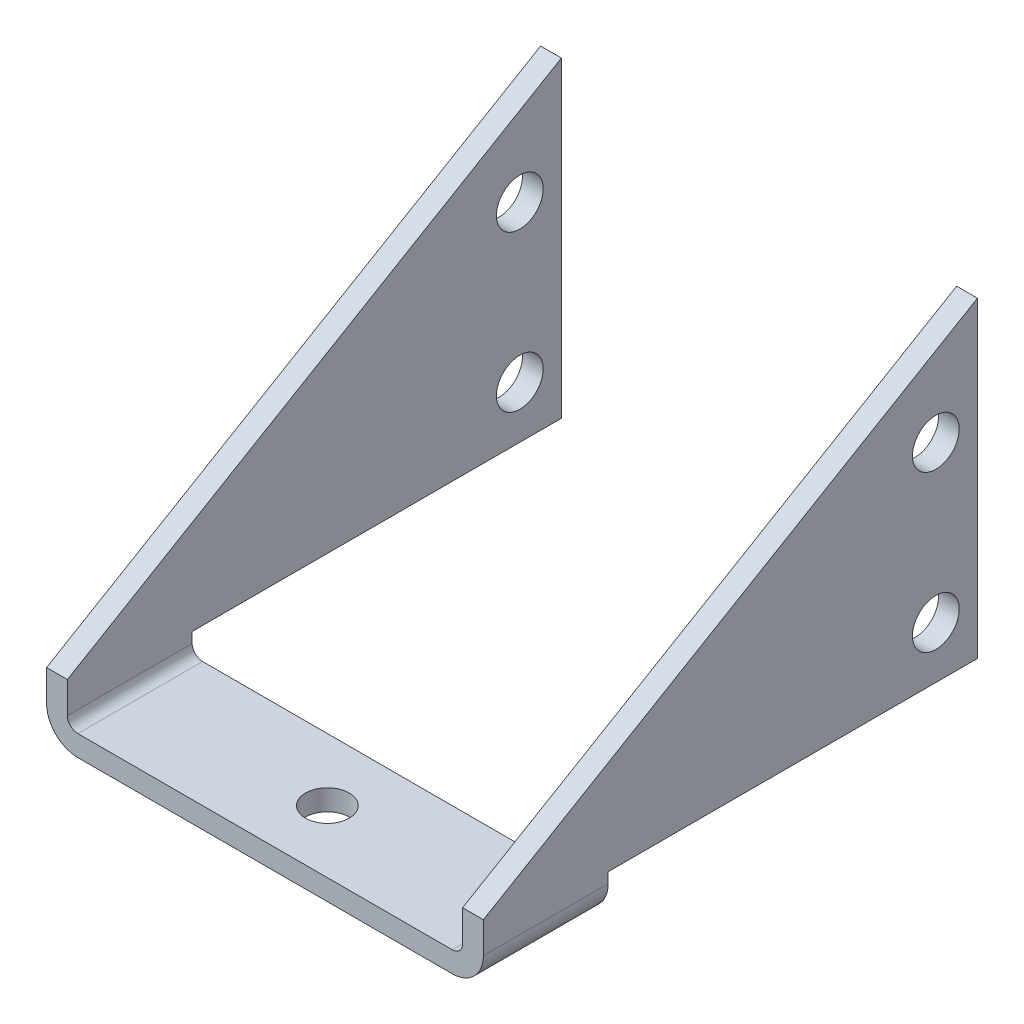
ISO-10303-21;
HEADER;
FILE_DESCRIPTION(('STEP AP214'),'2;1');
FILE_NAME('part.step','',(''),(''),'','','');
FILE_SCHEMA(('AUTOMOTIVE_DESIGN { 1 0 10303 214 1 1 1 1 }'));
ENDSEC;
DATA;
#1=APPLICATION_CONTEXT('core data for automotive mechanical design processes');
#2=APPLICATION_PROTOCOL_DEFINITION('international standard','automotive_design',2000,#1);
#3=PRODUCT_CONTEXT('',#1,'mechanical');
#4=PRODUCT('Part','Part','',(#3));
#5=PRODUCT_RELATED_PRODUCT_CATEGORY('part','',(#4));
#6=PRODUCT_DEFINITION_FORMATION('','',#4);
#7=PRODUCT_DEFINITION_CONTEXT('part definition',#1,'design');
#8=PRODUCT_DEFINITION('design','',#6,#7);
#9=PRODUCT_DEFINITION_SHAPE('','',#8);
#10=(LENGTH_UNIT() NAMED_UNIT(*) SI_UNIT(.MILLI.,.METRE.));
#11=(NAMED_UNIT(*) PLANE_ANGLE_UNIT() SI_UNIT($,.RADIAN.));
#12=(NAMED_UNIT(*) SI_UNIT($,.STERADIAN.) SOLID_ANGLE_UNIT());
#13=UNCERTAINTY_MEASURE_WITH_UNIT(LENGTH_MEASURE(1.E-05),#10,'distance_accuracy_value','');
#14=(GEOMETRIC_REPRESENTATION_CONTEXT(3) GLOBAL_UNCERTAINTY_ASSIGNED_CONTEXT((#13)) GLOBAL_UNIT_ASSIGNED_CONTEXT((#10,
#11,#12)) REPRESENTATION_CONTEXT('',''));
#15=CARTESIAN_POINT('',(0.,0.,0.));
#16=DIRECTION('',(0.,0.,1.));
#17=DIRECTION('',(1.,0.,0.));
#18=AXIS2_PLACEMENT_3D('',#15,#16,#17);
#19=CARTESIAN_POINT('',(21.,0.,0.));
#20=DIRECTION('',(-1.,0.,0.));
#21=DIRECTION('',(0.,0.,1.));
#22=AXIS2_PLACEMENT_3D('',#19,#20,#21);
#23=PLANE('',#22);
#24=DIRECTION('',(0.,0.,1.));
#25=VECTOR('',#24,1.);
#26=CARTESIAN_POINT('',(21.,4.,0.));
#27=LINE('',#26,#25);
#28=CARTESIAN_POINT('',(21.,4.,-6.));
#29=VERTEX_POINT('',#28);
#30=CARTESIAN_POINT('',(21.,4.,-41.5));
#31=VERTEX_POINT('',#30);
#32=EDGE_CURVE('E196',#29,#31,#27,.F.);
#33=ORIENTED_EDGE('',*,*,#32,.T.);
#34=DIRECTION('',(0.,1.,0.));
#35=VECTOR('',#34,1.);
#36=CARTESIAN_POINT('',(21.,34.,-41.5));
#37=LINE('',#36,#35);
#38=CARTESIAN_POINT('',(21.,34.,-41.5));
#39=VERTEX_POINT('',#38);
#40=EDGE_CURVE('E191',#31,#39,#37,.T.);
#41=ORIENTED_EDGE('',*,*,#40,.T.);
#42=DIRECTION('',(0.,0.507812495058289,-0.861467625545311));
#43=VECTOR('',#42,1.);
#44=CARTESIAN_POINT('',(21.,6.,6.));
#45=LINE('',#44,#43);
#46=CARTESIAN_POINT('',(21.,6.,6.));
#47=VERTEX_POINT('',#46);
#48=EDGE_CURVE('E171',#39,#47,#45,.F.);
#49=ORIENTED_EDGE('',*,*,#48,.T.);
#50=DIRECTION('',(0.,1.,0.));
#51=VECTOR('',#50,1.);
#52=CARTESIAN_POINT('',(21.,0.,6.));
#53=LINE('',#52,#51);
#54=CARTESIAN_POINT('',(21.,3.,6.));
#55=VERTEX_POINT('',#54);
#56=EDGE_CURVE('E168',#47,#55,#53,.F.);
#57=ORIENTED_EDGE('',*,*,#56,.T.);
#58=DIRECTION('',(0.,0.,-1.));
#59=VECTOR('',#58,1.);
#60=CARTESIAN_POINT('',(21.,3.,0.));
#61=LINE('',#60,#59);
#62=CARTESIAN_POINT('',(21.,3.,-6.));
#63=VERTEX_POINT('',#62);
#64=EDGE_CURVE('E158',#63,#55,#61,.F.);
#65=ORIENTED_EDGE('',*,*,#64,.F.);
#66=DIRECTION('',(0.,1.,0.));
#67=VECTOR('',#66,1.);
#68=CARTESIAN_POINT('',(21.,0.,-6.));
#69=LINE('',#68,#67);
#70=EDGE_CURVE('E140',#63,#29,#69,.T.);
#71=ORIENTED_EDGE('',*,*,#70,.T.);
#72=EDGE_LOOP('',(#33,#41,#49,#57,#65,#71));
#73=FACE_BOUND('',#72,.T.);
#74=CARTESIAN_POINT('',(21.,9.,-37.5));
#75=DIRECTION('',(1.,0.,0.));
#76=DIRECTION('',(0.,0.,-1.));
#77=AXIS2_PLACEMENT_3D('',#74,#75,#76);
#78=CIRCLE('',#77,2.25);
#79=CARTESIAN_POINT('',(21.,9.,-39.75));
#80=VERTEX_POINT('',#79);
#81=EDGE_CURVE('E166',#80,#80,#78,.F.);
#82=ORIENTED_EDGE('',*,*,#81,.T.);
#83=EDGE_LOOP('',(#82));
#84=FACE_BOUND('',#83,.T.);
#85=CARTESIAN_POINT('',(21.,24.,-37.5));
#86=DIRECTION('',(1.,0.,0.));
#87=DIRECTION('',(0.,0.,-1.));
#88=AXIS2_PLACEMENT_3D('',#85,#86,#87);
#89=CIRCLE('',#88,2.25);
#90=CARTESIAN_POINT('',(21.,24.,-39.75));
#91=VERTEX_POINT('',#90);
#92=EDGE_CURVE('E19',#91,#91,#89,.F.);
#93=ORIENTED_EDGE('',*,*,#92,.T.);
#94=EDGE_LOOP('',(#93));
#95=FACE_BOUND('',#94,.T.);
#96=ADVANCED_FACE('F16',(#73,#84,#95),#23,.F.);
#97=CARTESIAN_POINT('',(-21.,24.,-37.5));
#98=DIRECTION('',(1.,0.,0.));
#99=DIRECTION('',(0.,0.,-1.));
#100=AXIS2_PLACEMENT_3D('',#97,#98,#99);
#101=CYLINDRICAL_SURFACE('',#100,2.25);
#102=CARTESIAN_POINT('',(19.,24.,-37.5));
#103=DIRECTION('',(1.,0.,0.));
#104=DIRECTION('',(0.,0.,-1.));
#105=AXIS2_PLACEMENT_3D('',#102,#103,#104);
#106=CIRCLE('',#105,2.25);
#107=CARTESIAN_POINT('',(19.,24.,-39.75));
#108=VERTEX_POINT('',#107);
#109=EDGE_CURVE('E245',#108,#108,#106,.T.);
#110=ORIENTED_EDGE('',*,*,#109,.F.);
#111=EDGE_LOOP('',(#110));
#112=FACE_BOUND('',#111,.T.);
#113=ORIENTED_EDGE('',*,*,#92,.F.);
#114=EDGE_LOOP('',(#113));
#115=FACE_BOUND('',#114,.T.);
#116=ADVANCED_FACE('F547',(#112,#115),#101,.F.);
#117=CARTESIAN_POINT('',(-21.,9.,-37.5));
#118=DIRECTION('',(1.,0.,0.));
#119=DIRECTION('',(0.,0.,-1.));
#120=AXIS2_PLACEMENT_3D('',#117,#118,#119);
#121=CYLINDRICAL_SURFACE('',#120,2.25);
#122=CARTESIAN_POINT('',(19.,9.,-37.5));
#123=DIRECTION('',(1.,0.,0.));
#124=DIRECTION('',(0.,0.,-1.));
#125=AXIS2_PLACEMENT_3D('',#122,#123,#124);
#126=CIRCLE('',#125,2.25);
#127=CARTESIAN_POINT('',(19.,9.,-39.75));
#128=VERTEX_POINT('',#127);
#129=EDGE_CURVE('E241',#128,#128,#126,.T.);
#130=ORIENTED_EDGE('',*,*,#129,.F.);
#131=EDGE_LOOP('',(#130));
#132=FACE_BOUND('',#131,.T.);
#133=ORIENTED_EDGE('',*,*,#81,.F.);
#134=EDGE_LOOP('',(#133));
#135=FACE_BOUND('',#134,.T.);
#136=ADVANCED_FACE('F538',(#132,#135),#121,.F.);
#137=CARTESIAN_POINT('',(19.,6.,6.));
#138=DIRECTION('',(0.,-0.861467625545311,-0.507812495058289));
#139=DIRECTION('',(0.,0.507812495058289,-0.861467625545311));
#140=AXIS2_PLACEMENT_3D('',#137,#138,#139);
#141=PLANE('',#140);
#142=ORIENTED_EDGE('',*,*,#48,.F.);
#143=DIRECTION('',(1.,0.,0.));
#144=VECTOR('',#143,1.);
#145=CARTESIAN_POINT('',(19.,34.,-41.5));
#146=LINE('',#145,#144);
#147=CARTESIAN_POINT('',(19.,34.,-41.5));
#148=VERTEX_POINT('',#147);
#149=EDGE_CURVE('E197',#39,#148,#146,.F.);
#150=ORIENTED_EDGE('',*,*,#149,.T.);
#151=DIRECTION('',(0.,0.507812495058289,-0.861467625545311));
#152=VECTOR('',#151,1.);
#153=CARTESIAN_POINT('',(19.,6.,6.));
#154=LINE('',#153,#152);
#155=CARTESIAN_POINT('',(19.,6.,6.));
#156=VERTEX_POINT('',#155);
#157=EDGE_CURVE('E276',#156,#148,#154,.T.);
#158=ORIENTED_EDGE('',*,*,#157,.F.);
#159=DIRECTION('',(1.,0.,0.));
#160=VECTOR('',#159,1.);
#161=CARTESIAN_POINT('',(19.,6.,6.));
#162=LINE('',#161,#160);
#163=EDGE_CURVE('E187',#47,#156,#162,.F.);
#164=ORIENTED_EDGE('',*,*,#163,.F.);
#165=EDGE_LOOP('',(#142,#150,#158,#164));
#166=FACE_BOUND('',#165,.T.);
#167=ADVANCED_FACE('F290',(#166),#141,.F.);
#168=CARTESIAN_POINT('',(19.,34.,-41.5));
#169=DIRECTION('',(0.,0.,1.));
#170=DIRECTION('',(1.,0.,0.));
#171=AXIS2_PLACEMENT_3D('',#168,#169,#170);
#172=PLANE('',#171);
#173=ORIENTED_EDGE('',*,*,#40,.F.);
#174=DIRECTION('',(1.,0.,0.));
#175=VECTOR('',#174,1.);
#176=CARTESIAN_POINT('',(19.,4.,-41.5));
#177=LINE('',#176,#175);
#178=CARTESIAN_POINT('',(19.,4.,-41.5));
#179=VERTEX_POINT('',#178);
#180=EDGE_CURVE('E163',#31,#179,#177,.F.);
#181=ORIENTED_EDGE('',*,*,#180,.T.);
#182=DIRECTION('',(0.,1.,0.));
#183=VECTOR('',#182,1.);
#184=CARTESIAN_POINT('',(19.,0.,-41.5));
#185=LINE('',#184,#183);
#186=EDGE_CURVE('E205',#148,#179,#185,.F.);
#187=ORIENTED_EDGE('',*,*,#186,.F.);
#188=ORIENTED_EDGE('',*,*,#149,.F.);
#189=EDGE_LOOP('',(#173,#181,#187,#188));
#190=FACE_BOUND('',#189,.T.);
#191=ADVANCED_FACE('F295',(#190),#172,.F.);
#192=CARTESIAN_POINT('',(19.,4.,0.));
#193=DIRECTION('',(0.,1.,0.));
#194=DIRECTION('',(0.,0.,1.));
#195=AXIS2_PLACEMENT_3D('',#192,#193,#194);
#196=PLANE('',#195);
#197=ORIENTED_EDGE('',*,*,#32,.F.);
#198=DIRECTION('',(1.,0.,0.));
#199=VECTOR('',#198,1.);
#200=CARTESIAN_POINT('',(19.,4.,-6.));
#201=LINE('',#200,#199);
#202=CARTESIAN_POINT('',(19.,4.,-6.));
#203=VERTEX_POINT('',#202);
#204=EDGE_CURVE('E194',#203,#29,#201,.T.);
#205=ORIENTED_EDGE('',*,*,#204,.F.);
#206=DIRECTION('',(0.,0.,1.));
#207=VECTOR('',#206,1.);
#208=CARTESIAN_POINT('',(19.,4.,0.));
#209=LINE('',#208,#207);
#210=EDGE_CURVE('E135',#179,#203,#209,.T.);
#211=ORIENTED_EDGE('',*,*,#210,.F.);
#212=ORIENTED_EDGE('',*,*,#180,.F.);
#213=EDGE_LOOP('',(#197,#205,#211,#212));
#214=FACE_BOUND('',#213,.T.);
#215=ADVANCED_FACE('F299',(#214),#196,.F.);
#216=CARTESIAN_POINT('',(18.,3.,0.));
#217=DIRECTION('',(0.,0.,-1.));
#218=DIRECTION('',(-1.,0.,0.));
#219=AXIS2_PLACEMENT_3D('',#216,#217,#218);
#220=CYLINDRICAL_SURFACE('',#219,3.);
#221=CARTESIAN_POINT('',(18.,3.,6.));
#222=DIRECTION('',(0.,0.,-1.));
#223=DIRECTION('',(-1.,0.,0.));
#224=AXIS2_PLACEMENT_3D('',#221,#222,#223);
#225=CIRCLE('',#224,3.);
#226=CARTESIAN_POINT('',(18.,0.,6.));
#227=VERTEX_POINT('',#226);
#228=EDGE_CURVE('E248',#55,#227,#225,.T.);
#229=ORIENTED_EDGE('',*,*,#228,.T.);
#230=DIRECTION('',(0.,0.,1.));
#231=VECTOR('',#230,1.);
#232=CARTESIAN_POINT('',(18.,0.,0.));
#233=LINE('',#232,#231);
#234=CARTESIAN_POINT('',(18.,0.,-6.));
#235=VERTEX_POINT('',#234);
#236=EDGE_CURVE('E204',#227,#235,#233,.F.);
#237=ORIENTED_EDGE('',*,*,#236,.T.);
#238=CARTESIAN_POINT('',(18.,3.,-6.));
#239=DIRECTION('',(0.,0.,-1.));
#240=DIRECTION('',(-1.,0.,0.));
#241=AXIS2_PLACEMENT_3D('',#238,#239,#240);
#242=CIRCLE('',#241,3.);
#243=EDGE_CURVE('E157',#235,#63,#242,.F.);
#244=ORIENTED_EDGE('',*,*,#243,.T.);
#245=ORIENTED_EDGE('',*,*,#64,.T.);
#246=EDGE_LOOP('',(#229,#237,#244,#245));
#247=FACE_BOUND('',#246,.T.);
#248=ADVANCED_FACE('F252',(#247),#220,.T.);
#249=CARTESIAN_POINT('',(19.,0.,0.));
#250=DIRECTION('',(-1.,0.,0.));
#251=DIRECTION('',(0.,0.,1.));
#252=AXIS2_PLACEMENT_3D('',#249,#250,#251);
#253=PLANE('',#252);
#254=ORIENTED_EDGE('',*,*,#186,.T.);
#255=ORIENTED_EDGE('',*,*,#210,.T.);
#256=DIRECTION('',(0.,1.,0.));
#257=VECTOR('',#256,1.);
#258=CARTESIAN_POINT('',(19.,0.,-6.));
#259=LINE('',#258,#257);
#260=CARTESIAN_POINT('',(19.,3.,-6.));
#261=VERTEX_POINT('',#260);
#262=EDGE_CURVE('E126',#203,#261,#259,.F.);
#263=ORIENTED_EDGE('',*,*,#262,.T.);
#264=DIRECTION('',(0.,0.,-1.));
#265=VECTOR('',#264,1.);
#266=CARTESIAN_POINT('',(19.,3.,0.));
#267=LINE('',#266,#265);
#268=CARTESIAN_POINT('',(19.,3.,6.));
#269=VERTEX_POINT('',#268);
#270=EDGE_CURVE('E132',#261,#269,#267,.F.);
#271=ORIENTED_EDGE('',*,*,#270,.T.);
#272=DIRECTION('',(0.,1.,0.));
#273=VECTOR('',#272,1.);
#274=CARTESIAN_POINT('',(19.,0.,6.));
#275=LINE('',#274,#273);
#276=EDGE_CURVE('E244',#269,#156,#275,.T.);
#277=ORIENTED_EDGE('',*,*,#276,.T.);
#278=ORIENTED_EDGE('',*,*,#157,.T.);
#279=EDGE_LOOP('',(#254,#255,#263,#271,#277,#278));
#280=FACE_BOUND('',#279,.T.);
#281=ORIENTED_EDGE('',*,*,#129,.T.);
#282=EDGE_LOOP('',(#281));
#283=FACE_BOUND('',#282,.T.);
#284=ORIENTED_EDGE('',*,*,#109,.T.);
#285=EDGE_LOOP('',(#284));
#286=FACE_BOUND('',#285,.T.);
#287=ADVANCED_FACE('F129',(#280,#283,#286),#253,.T.);
#288=CARTESIAN_POINT('',(0.,0.,0.));
#289=DIRECTION('',(0.,1.,0.));
#290=DIRECTION('',(0.,0.,1.));
#291=AXIS2_PLACEMENT_3D('',#288,#289,#290);
#292=PLANE('',#291);
#293=ORIENTED_EDGE('',*,*,#236,.F.);
#294=DIRECTION('',(1.,0.,0.));
#295=VECTOR('',#294,1.);
#296=CARTESIAN_POINT('',(-21.,0.,6.));
#297=LINE('',#296,#295);
#298=CARTESIAN_POINT('',(-18.,0.,6.));
#299=VERTEX_POINT('',#298);
#300=EDGE_CURVE('E150',#299,#227,#297,.T.);
#301=ORIENTED_EDGE('',*,*,#300,.F.);
#302=DIRECTION('',(0.,0.,1.));
#303=VECTOR('',#302,1.);
#304=CARTESIAN_POINT('',(-18.,0.,0.));
#305=LINE('',#304,#303);
#306=CARTESIAN_POINT('',(-18.,0.,-6.));
#307=VERTEX_POINT('',#306);
#308=EDGE_CURVE('E232',#307,#299,#305,.T.);
#309=ORIENTED_EDGE('',*,*,#308,.F.);
#310=DIRECTION('',(-1.,0.,0.));
#311=VECTOR('',#310,1.);
#312=CARTESIAN_POINT('',(-21.,0.,-6.));
#313=LINE('',#312,#311);
#314=EDGE_CURVE('E240',#235,#307,#313,.T.);
#315=ORIENTED_EDGE('',*,*,#314,.F.);
#316=EDGE_LOOP('',(#293,#301,#309,#315));
#317=FACE_BOUND('',#316,.T.);
#318=CARTESIAN_POINT('',(0.,0.,0.));
#319=DIRECTION('',(0.,1.,0.));
#320=DIRECTION('',(0.,0.,1.));
#321=AXIS2_PLACEMENT_3D('',#318,#319,#320);
#322=CIRCLE('',#321,2.1);
#323=CARTESIAN_POINT('',(0.,0.,2.1));
#324=VERTEX_POINT('',#323);
#325=EDGE_CURVE('E237',#324,#324,#322,.T.);
#326=ORIENTED_EDGE('',*,*,#325,.T.);
#327=EDGE_LOOP('',(#326));
#328=FACE_BOUND('',#327,.T.);
#329=ADVANCED_FACE('F259',(#317,#328),#292,.F.);
#330=CARTESIAN_POINT('',(0.,2.,0.));
#331=DIRECTION('',(0.,1.,0.));
#332=DIRECTION('',(0.,0.,1.));
#333=AXIS2_PLACEMENT_3D('',#330,#331,#332);
#334=CYLINDRICAL_SURFACE('',#333,2.1);
#335=CARTESIAN_POINT('',(0.,2.,0.));
#336=DIRECTION('',(0.,1.,0.));
#337=DIRECTION('',(0.,0.,1.));
#338=AXIS2_PLACEMENT_3D('',#335,#336,#337);
#339=CIRCLE('',#338,2.1);
#340=CARTESIAN_POINT('',(0.,2.,2.1));
#341=VERTEX_POINT('',#340);
#342=EDGE_CURVE('E224',#341,#341,#339,.F.);
#343=ORIENTED_EDGE('',*,*,#342,.F.);
#344=EDGE_LOOP('',(#343));
#345=FACE_BOUND('',#344,.T.);
#346=ORIENTED_EDGE('',*,*,#325,.F.);
#347=EDGE_LOOP('',(#346));
#348=FACE_BOUND('',#347,.T.);
#349=ADVANCED_FACE('F479',(#345,#348),#334,.F.);
#350=CARTESIAN_POINT('',(18.,3.,0.));
#351=DIRECTION('',(0.,0.,-1.));
#352=DIRECTION('',(-1.,0.,0.));
#353=AXIS2_PLACEMENT_3D('',#350,#351,#352);
#354=CYLINDRICAL_SURFACE('',#353,1.);
#355=DIRECTION('',(0.,0.,1.));
#356=VECTOR('',#355,1.);
#357=CARTESIAN_POINT('',(18.,2.,0.));
#358=LINE('',#357,#356);
#359=CARTESIAN_POINT('',(18.,2.,6.));
#360=VERTEX_POINT('',#359);
#361=CARTESIAN_POINT('',(18.,2.,-6.));
#362=VERTEX_POINT('',#361);
#363=EDGE_CURVE('E279',#360,#362,#358,.F.);
#364=ORIENTED_EDGE('',*,*,#363,.F.);
#365=CARTESIAN_POINT('',(18.,3.,6.));
#366=DIRECTION('',(0.,0.,-1.));
#367=DIRECTION('',(-1.,0.,0.));
#368=AXIS2_PLACEMENT_3D('',#365,#366,#367);
#369=CIRCLE('',#368,1.);
#370=EDGE_CURVE('E148',#360,#269,#369,.F.);
#371=ORIENTED_EDGE('',*,*,#370,.T.);
#372=ORIENTED_EDGE('',*,*,#270,.F.);
#373=CARTESIAN_POINT('',(18.,3.,-6.));
#374=DIRECTION('',(0.,0.,-1.));
#375=DIRECTION('',(-1.,0.,0.));
#376=AXIS2_PLACEMENT_3D('',#373,#374,#375);
#377=CIRCLE('',#376,1.);
#378=EDGE_CURVE('E146',#261,#362,#377,.T.);
#379=ORIENTED_EDGE('',*,*,#378,.T.);
#380=EDGE_LOOP('',(#364,#371,#372,#379));
#381=FACE_BOUND('',#380,.T.);
#382=ADVANCED_FACE('F145',(#381),#354,.F.);
#383=CARTESIAN_POINT('',(-18.,3.,0.));
#384=DIRECTION('',(0.,0.,1.));
#385=DIRECTION('',(1.,0.,0.));
#386=AXIS2_PLACEMENT_3D('',#383,#384,#385);
#387=CYLINDRICAL_SURFACE('',#386,3.);
#388=CARTESIAN_POINT('',(-18.,3.,-6.));
#389=DIRECTION('',(0.,0.,1.));
#390=DIRECTION('',(1.,0.,0.));
#391=AXIS2_PLACEMENT_3D('',#388,#389,#390);
#392=CIRCLE('',#391,3.);
#393=CARTESIAN_POINT('',(-21.,3.,-6.));
#394=VERTEX_POINT('',#393);
#395=EDGE_CURVE('E233',#394,#307,#392,.T.);
#396=ORIENTED_EDGE('',*,*,#395,.T.);
#397=ORIENTED_EDGE('',*,*,#308,.T.);
#398=CARTESIAN_POINT('',(-18.,3.,6.));
#399=DIRECTION('',(0.,0.,1.));
#400=DIRECTION('',(1.,0.,0.));
#401=AXIS2_PLACEMENT_3D('',#398,#399,#400);
#402=CIRCLE('',#401,3.);
#403=CARTESIAN_POINT('',(-21.,3.,6.));
#404=VERTEX_POINT('',#403);
#405=EDGE_CURVE('E229',#404,#299,#402,.T.);
#406=ORIENTED_EDGE('',*,*,#405,.F.);
#407=DIRECTION('',(0.,0.,-1.));
#408=VECTOR('',#407,1.);
#409=CARTESIAN_POINT('',(-21.,3.,0.));
#410=LINE('',#409,#408);
#411=EDGE_CURVE('E304',#404,#394,#410,.T.);
#412=ORIENTED_EDGE('',*,*,#411,.T.);
#413=EDGE_LOOP('',(#396,#397,#406,#412));
#414=FACE_BOUND('',#413,.T.);
#415=ADVANCED_FACE('F302',(#414),#387,.T.);
#416=CARTESIAN_POINT('',(0.,2.,0.));
#417=DIRECTION('',(0.,1.,0.));
#418=DIRECTION('',(0.,0.,1.));
#419=AXIS2_PLACEMENT_3D('',#416,#417,#418);
#420=PLANE('',#419);
#421=DIRECTION('',(1.,0.,0.));
#422=VECTOR('',#421,1.);
#423=CARTESIAN_POINT('',(0.,2.,6.));
#424=LINE('',#423,#422);
#425=CARTESIAN_POINT('',(-18.,2.,6.));
#426=VERTEX_POINT('',#425);
#427=EDGE_CURVE('E274',#426,#360,#424,.T.);
#428=ORIENTED_EDGE('',*,*,#427,.T.);
#429=ORIENTED_EDGE('',*,*,#363,.T.);
#430=DIRECTION('',(1.,0.,0.));
#431=VECTOR('',#430,1.);
#432=CARTESIAN_POINT('',(0.,2.,-6.));
#433=LINE('',#432,#431);
#434=CARTESIAN_POINT('',(-18.,2.,-6.));
#435=VERTEX_POINT('',#434);
#436=EDGE_CURVE('E155',#362,#435,#433,.F.);
#437=ORIENTED_EDGE('',*,*,#436,.T.);
#438=DIRECTION('',(0.,0.,1.));
#439=VECTOR('',#438,1.);
#440=CARTESIAN_POINT('',(-18.,2.,0.));
#441=LINE('',#440,#439);
#442=EDGE_CURVE('E270',#435,#426,#441,.T.);
#443=ORIENTED_EDGE('',*,*,#442,.T.);
#444=EDGE_LOOP('',(#428,#429,#437,#443));
#445=FACE_BOUND('',#444,.T.);
#446=ORIENTED_EDGE('',*,*,#342,.T.);
#447=EDGE_LOOP('',(#446));
#448=FACE_BOUND('',#447,.T.);
#449=ADVANCED_FACE('F337',(#445,#448),#420,.T.);
#450=CARTESIAN_POINT('',(-19.,0.,-6.));
#451=DIRECTION('',(0.,0.,1.));
#452=DIRECTION('',(1.,0.,0.));
#453=AXIS2_PLACEMENT_3D('',#450,#451,#452);
#454=PLANE('',#453);
#455=DIRECTION('',(0.,1.,0.));
#456=VECTOR('',#455,1.);
#457=CARTESIAN_POINT('',(-21.,0.,-6.));
#458=LINE('',#457,#456);
#459=CARTESIAN_POINT('',(-21.,4.,-6.));
#460=VERTEX_POINT('',#459);
#461=EDGE_CURVE('E223',#394,#460,#458,.T.);
#462=ORIENTED_EDGE('',*,*,#461,.T.);
#463=DIRECTION('',(1.,0.,0.));
#464=VECTOR('',#463,1.);
#465=CARTESIAN_POINT('',(-19.,4.,-6.));
#466=LINE('',#465,#464);
#467=CARTESIAN_POINT('',(-19.,4.,-6.));
#468=VERTEX_POINT('',#467);
#469=EDGE_CURVE('E324',#460,#468,#466,.T.);
#470=ORIENTED_EDGE('',*,*,#469,.T.);
#471=DIRECTION('',(0.,1.,0.));
#472=VECTOR('',#471,1.);
#473=CARTESIAN_POINT('',(-19.,0.,-6.));
#474=LINE('',#473,#472);
#475=CARTESIAN_POINT('',(-19.,3.,-6.));
#476=VERTEX_POINT('',#475);
#477=EDGE_CURVE('E280',#476,#468,#474,.T.);
#478=ORIENTED_EDGE('',*,*,#477,.F.);
#479=CARTESIAN_POINT('',(-18.,3.,-6.));
#480=DIRECTION('',(0.,0.,1.));
#481=DIRECTION('',(1.,0.,0.));
#482=AXIS2_PLACEMENT_3D('',#479,#480,#481);
#483=CIRCLE('',#482,1.);
#484=EDGE_CURVE('E149',#435,#476,#483,.F.);
#485=ORIENTED_EDGE('',*,*,#484,.F.);
#486=ORIENTED_EDGE('',*,*,#436,.F.);
#487=ORIENTED_EDGE('',*,*,#378,.F.);
#488=ORIENTED_EDGE('',*,*,#262,.F.);
#489=ORIENTED_EDGE('',*,*,#204,.T.);
#490=ORIENTED_EDGE('',*,*,#70,.F.);
#491=ORIENTED_EDGE('',*,*,#243,.F.);
#492=ORIENTED_EDGE('',*,*,#314,.T.);
#493=ORIENTED_EDGE('',*,*,#395,.F.);
#494=EDGE_LOOP('',(#462,#470,#478,#485,#486,#487,#488,#489,#490,#491,#492,#493));
#495=FACE_BOUND('',#494,.T.);
#496=ADVANCED_FACE('F152',(#495),#454,.F.);
#497=CARTESIAN_POINT('',(-21.,0.,0.));
#498=DIRECTION('',(1.,0.,0.));
#499=DIRECTION('',(0.,0.,-1.));
#500=AXIS2_PLACEMENT_3D('',#497,#498,#499);
#501=PLANE('',#500);
#502=DIRECTION('',(0.,-0.507812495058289,0.861467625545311));
#503=VECTOR('',#502,1.);
#504=CARTESIAN_POINT('',(-21.,6.,6.));
#505=LINE('',#504,#503);
#506=CARTESIAN_POINT('',(-21.,34.,-41.5));
#507=VERTEX_POINT('',#506);
#508=CARTESIAN_POINT('',(-21.,6.,6.));
#509=VERTEX_POINT('',#508);
#510=EDGE_CURVE('E356',#507,#509,#505,.T.);
#511=ORIENTED_EDGE('',*,*,#510,.F.);
#512=DIRECTION('',(0.,1.,0.));
#513=VECTOR('',#512,1.);
#514=CARTESIAN_POINT('',(-21.,34.,-41.5));
#515=LINE('',#514,#513);
#516=CARTESIAN_POINT('',(-21.,4.,-41.5));
#517=VERTEX_POINT('',#516);
#518=EDGE_CURVE('E360',#517,#507,#515,.T.);
#519=ORIENTED_EDGE('',*,*,#518,.F.);
#520=DIRECTION('',(0.,0.,1.));
#521=VECTOR('',#520,1.);
#522=CARTESIAN_POINT('',(-21.,4.,0.));
#523=LINE('',#522,#521);
#524=EDGE_CURVE('E313',#517,#460,#523,.T.);
#525=ORIENTED_EDGE('',*,*,#524,.T.);
#526=ORIENTED_EDGE('',*,*,#461,.F.);
#527=ORIENTED_EDGE('',*,*,#411,.F.);
#528=DIRECTION('',(0.,1.,0.));
#529=VECTOR('',#528,1.);
#530=CARTESIAN_POINT('',(-21.,0.,6.));
#531=LINE('',#530,#529);
#532=EDGE_CURVE('E219',#509,#404,#531,.F.);
#533=ORIENTED_EDGE('',*,*,#532,.F.);
#534=EDGE_LOOP('',(#511,#519,#525,#526,#527,#533));
#535=FACE_BOUND('',#534,.T.);
#536=CARTESIAN_POINT('',(-21.,9.,-37.5));
#537=DIRECTION('',(1.,0.,0.));
#538=DIRECTION('',(0.,0.,-1.));
#539=AXIS2_PLACEMENT_3D('',#536,#537,#538);
#540=CIRCLE('',#539,2.25);
#541=CARTESIAN_POINT('',(-21.,9.,-39.75));
#542=VERTEX_POINT('',#541);
#543=EDGE_CURVE('E216',#542,#542,#540,.T.);
#544=ORIENTED_EDGE('',*,*,#543,.T.);
#545=EDGE_LOOP('',(#544));
#546=FACE_BOUND('',#545,.T.);
#547=CARTESIAN_POINT('',(-21.,24.,-37.5));
#548=DIRECTION('',(1.,0.,0.));
#549=DIRECTION('',(0.,0.,-1.));
#550=AXIS2_PLACEMENT_3D('',#547,#548,#549);
#551=CIRCLE('',#550,2.25);
#552=CARTESIAN_POINT('',(-21.,24.,-39.75));
#553=VERTEX_POINT('',#552);
#554=EDGE_CURVE('E220',#553,#553,#551,.T.);
#555=ORIENTED_EDGE('',*,*,#554,.T.);
#556=EDGE_LOOP('',(#555));
#557=FACE_BOUND('',#556,.T.);
#558=ADVANCED_FACE('F310',(#535,#546,#557),#501,.F.);
#559=CARTESIAN_POINT('',(-21.,24.,-37.5));
#560=DIRECTION('',(1.,0.,0.));
#561=DIRECTION('',(0.,0.,-1.));
#562=AXIS2_PLACEMENT_3D('',#559,#560,#561);
#563=CYLINDRICAL_SURFACE('',#562,2.25);
#564=CARTESIAN_POINT('',(-19.,24.,-37.5));
#565=DIRECTION('',(1.,0.,0.));
#566=DIRECTION('',(0.,0.,-1.));
#567=AXIS2_PLACEMENT_3D('',#564,#565,#566);
#568=CIRCLE('',#567,2.25);
#569=CARTESIAN_POINT('',(-19.,24.,-39.75));
#570=VERTEX_POINT('',#569);
#571=EDGE_CURVE('E212',#570,#570,#568,.F.);
#572=ORIENTED_EDGE('',*,*,#571,.F.);
#573=EDGE_LOOP('',(#572));
#574=FACE_BOUND('',#573,.T.);
#575=ORIENTED_EDGE('',*,*,#554,.F.);
#576=EDGE_LOOP('',(#575));
#577=FACE_BOUND('',#576,.T.);
#578=ADVANCED_FACE('F428',(#574,#577),#563,.F.);
#579=CARTESIAN_POINT('',(-21.,9.,-37.5));
#580=DIRECTION('',(1.,0.,0.));
#581=DIRECTION('',(0.,0.,-1.));
#582=AXIS2_PLACEMENT_3D('',#579,#580,#581);
#583=CYLINDRICAL_SURFACE('',#582,2.25);
#584=CARTESIAN_POINT('',(-19.,9.,-37.5));
#585=DIRECTION('',(1.,0.,0.));
#586=DIRECTION('',(0.,0.,-1.));
#587=AXIS2_PLACEMENT_3D('',#584,#585,#586);
#588=CIRCLE('',#587,2.25);
#589=CARTESIAN_POINT('',(-19.,9.,-39.75));
#590=VERTEX_POINT('',#589);
#591=EDGE_CURVE('E208',#590,#590,#588,.F.);
#592=ORIENTED_EDGE('',*,*,#591,.F.);
#593=EDGE_LOOP('',(#592));
#594=FACE_BOUND('',#593,.T.);
#595=ORIENTED_EDGE('',*,*,#543,.F.);
#596=EDGE_LOOP('',(#595));
#597=FACE_BOUND('',#596,.T.);
#598=ADVANCED_FACE('F419',(#594,#597),#583,.F.);
#599=CARTESIAN_POINT('',(-19.,0.,6.));
#600=DIRECTION('',(0.,0.,1.));
#601=DIRECTION('',(1.,0.,0.));
#602=AXIS2_PLACEMENT_3D('',#599,#600,#601);
#603=PLANE('',#602);
#604=ORIENTED_EDGE('',*,*,#532,.T.);
#605=ORIENTED_EDGE('',*,*,#405,.T.);
#606=ORIENTED_EDGE('',*,*,#300,.T.);
#607=ORIENTED_EDGE('',*,*,#228,.F.);
#608=ORIENTED_EDGE('',*,*,#56,.F.);
#609=ORIENTED_EDGE('',*,*,#163,.T.);
#610=ORIENTED_EDGE('',*,*,#276,.F.);
#611=ORIENTED_EDGE('',*,*,#370,.F.);
#612=ORIENTED_EDGE('',*,*,#427,.F.);
#613=CARTESIAN_POINT('',(-18.,3.,6.));
#614=DIRECTION('',(0.,0.,1.));
#615=DIRECTION('',(1.,0.,0.));
#616=AXIS2_PLACEMENT_3D('',#613,#614,#615);
#617=CIRCLE('',#616,1.);
#618=CARTESIAN_POINT('',(-19.,3.,6.));
#619=VERTEX_POINT('',#618);
#620=EDGE_CURVE('E227',#426,#619,#617,.F.);
#621=ORIENTED_EDGE('',*,*,#620,.T.);
#622=DIRECTION('',(0.,1.,0.));
#623=VECTOR('',#622,1.);
#624=CARTESIAN_POINT('',(-19.,0.,6.));
#625=LINE('',#624,#623);
#626=CARTESIAN_POINT('',(-19.,6.,6.));
#627=VERTEX_POINT('',#626);
#628=EDGE_CURVE('E211',#627,#619,#625,.F.);
#629=ORIENTED_EDGE('',*,*,#628,.F.);
#630=DIRECTION('',(1.,0.,0.));
#631=VECTOR('',#630,1.);
#632=CARTESIAN_POINT('',(-19.,6.,6.));
#633=LINE('',#632,#631);
#634=EDGE_CURVE('E215',#509,#627,#633,.T.);
#635=ORIENTED_EDGE('',*,*,#634,.F.);
#636=EDGE_LOOP('',(#604,#605,#606,#607,#608,#609,#610,#611,#612,#621,#629,#635));
#637=FACE_BOUND('',#636,.T.);
#638=ADVANCED_FACE('F265',(#637),#603,.T.);
#639=CARTESIAN_POINT('',(-18.,3.,0.));
#640=DIRECTION('',(0.,0.,1.));
#641=DIRECTION('',(1.,0.,0.));
#642=AXIS2_PLACEMENT_3D('',#639,#640,#641);
#643=CYLINDRICAL_SURFACE('',#642,1.);
#644=ORIENTED_EDGE('',*,*,#442,.F.);
#645=ORIENTED_EDGE('',*,*,#484,.T.);
#646=DIRECTION('',(0.,0.,-1.));
#647=VECTOR('',#646,1.);
#648=CARTESIAN_POINT('',(-19.,3.,0.));
#649=LINE('',#648,#647);
#650=EDGE_CURVE('E332',#619,#476,#649,.T.);
#651=ORIENTED_EDGE('',*,*,#650,.F.);
#652=ORIENTED_EDGE('',*,*,#620,.F.);
#653=EDGE_LOOP('',(#644,#645,#651,#652));
#654=FACE_BOUND('',#653,.T.);
#655=ADVANCED_FACE('F345',(#654),#643,.F.);
#656=CARTESIAN_POINT('',(-19.,4.,0.));
#657=DIRECTION('',(0.,1.,0.));
#658=DIRECTION('',(0.,0.,1.));
#659=AXIS2_PLACEMENT_3D('',#656,#657,#658);
#660=PLANE('',#659);
#661=ORIENTED_EDGE('',*,*,#524,.F.);
#662=DIRECTION('',(-1.,0.,0.));
#663=VECTOR('',#662,1.);
#664=CARTESIAN_POINT('',(-19.,4.,-41.5));
#665=LINE('',#664,#663);
#666=CARTESIAN_POINT('',(-19.,4.,-41.5));
#667=VERTEX_POINT('',#666);
#668=EDGE_CURVE('E326',#667,#517,#665,.T.);
#669=ORIENTED_EDGE('',*,*,#668,.F.);
#670=DIRECTION('',(0.,0.,-1.));
#671=VECTOR('',#670,1.);
#672=CARTESIAN_POINT('',(-19.,4.,0.));
#673=LINE('',#672,#671);
#674=EDGE_CURVE('E329',#468,#667,#673,.T.);
#675=ORIENTED_EDGE('',*,*,#674,.F.);
#676=ORIENTED_EDGE('',*,*,#469,.F.);
#677=EDGE_LOOP('',(#661,#669,#675,#676));
#678=FACE_BOUND('',#677,.T.);
#679=ADVANCED_FACE('F372',(#678),#660,.F.);
#680=CARTESIAN_POINT('',(-19.,34.,-41.5));
#681=DIRECTION('',(0.,0.,-1.));
#682=DIRECTION('',(-1.,0.,0.));
#683=AXIS2_PLACEMENT_3D('',#680,#681,#682);
#684=PLANE('',#683);
#685=DIRECTION('',(1.,0.,0.));
#686=VECTOR('',#685,1.);
#687=CARTESIAN_POINT('',(-19.,34.,-41.5));
#688=LINE('',#687,#686);
#689=CARTESIAN_POINT('',(-19.,34.,-41.5));
#690=VERTEX_POINT('',#689);
#691=EDGE_CURVE('E34',#690,#507,#688,.F.);
#692=ORIENTED_EDGE('',*,*,#691,.F.);
#693=DIRECTION('',(0.,1.,0.));
#694=VECTOR('',#693,1.);
#695=CARTESIAN_POINT('',(-19.,0.,-41.5));
#696=LINE('',#695,#694);
#697=EDGE_CURVE('E25',#667,#690,#696,.T.);
#698=ORIENTED_EDGE('',*,*,#697,.F.);
#699=ORIENTED_EDGE('',*,*,#668,.T.);
#700=ORIENTED_EDGE('',*,*,#518,.T.);
#701=EDGE_LOOP('',(#692,#698,#699,#700));
#702=FACE_BOUND('',#701,.T.);
#703=ADVANCED_FACE('F369',(#702),#684,.T.);
#704=CARTESIAN_POINT('',(-19.,6.,6.));
#705=DIRECTION('',(0.,0.861467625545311,0.507812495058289));
#706=DIRECTION('',(0.,-0.507812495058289,0.861467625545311));
#707=AXIS2_PLACEMENT_3D('',#704,#705,#706);
#708=PLANE('',#707);
#709=ORIENTED_EDGE('',*,*,#634,.T.);
#710=DIRECTION('',(0.,-0.507812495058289,0.861467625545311));
#711=VECTOR('',#710,1.);
#712=CARTESIAN_POINT('',(-19.,34.,-41.5));
#713=LINE('',#712,#711);
#714=EDGE_CURVE('E10',#690,#627,#713,.T.);
#715=ORIENTED_EDGE('',*,*,#714,.F.);
#716=ORIENTED_EDGE('',*,*,#691,.T.);
#717=ORIENTED_EDGE('',*,*,#510,.T.);
#718=EDGE_LOOP('',(#709,#715,#716,#717));
#719=FACE_BOUND('',#718,.T.);
#720=ADVANCED_FACE('F380',(#719),#708,.T.);
#721=CARTESIAN_POINT('',(-19.,0.,0.));
#722=DIRECTION('',(1.,0.,0.));
#723=DIRECTION('',(0.,0.,-1.));
#724=AXIS2_PLACEMENT_3D('',#721,#722,#723);
#725=PLANE('',#724);
#726=ORIENTED_EDGE('',*,*,#697,.T.);
#727=ORIENTED_EDGE('',*,*,#714,.T.);
#728=ORIENTED_EDGE('',*,*,#628,.T.);
#729=ORIENTED_EDGE('',*,*,#650,.T.);
#730=ORIENTED_EDGE('',*,*,#477,.T.);
#731=ORIENTED_EDGE('',*,*,#674,.T.);
#732=EDGE_LOOP('',(#726,#727,#728,#729,#730,#731));
#733=FACE_BOUND('',#732,.T.);
#734=ORIENTED_EDGE('',*,*,#591,.T.);
#735=EDGE_LOOP('',(#734));
#736=FACE_BOUND('',#735,.T.);
#737=ORIENTED_EDGE('',*,*,#571,.T.);
#738=EDGE_LOOP('',(#737));
#739=FACE_BOUND('',#738,.T.);
#740=ADVANCED_FACE('F350',(#733,#736,#739),#725,.T.);
#741=CLOSED_SHELL('',(#96,#116,#136,#167,#191,#215,#248,#287,#329,#349,#382,#415,#449,#496,#558,
#578,#598,#638,#655,#679,#703,#720,#740));
#742=MANIFOLD_SOLID_BREP('B1',#741);
#743=ADVANCED_BREP_SHAPE_REPRESENTATION('',(#18,#742),#14);
#744=SHAPE_DEFINITION_REPRESENTATION(#9,#743);
ENDSEC;
END-ISO-10303-21;
